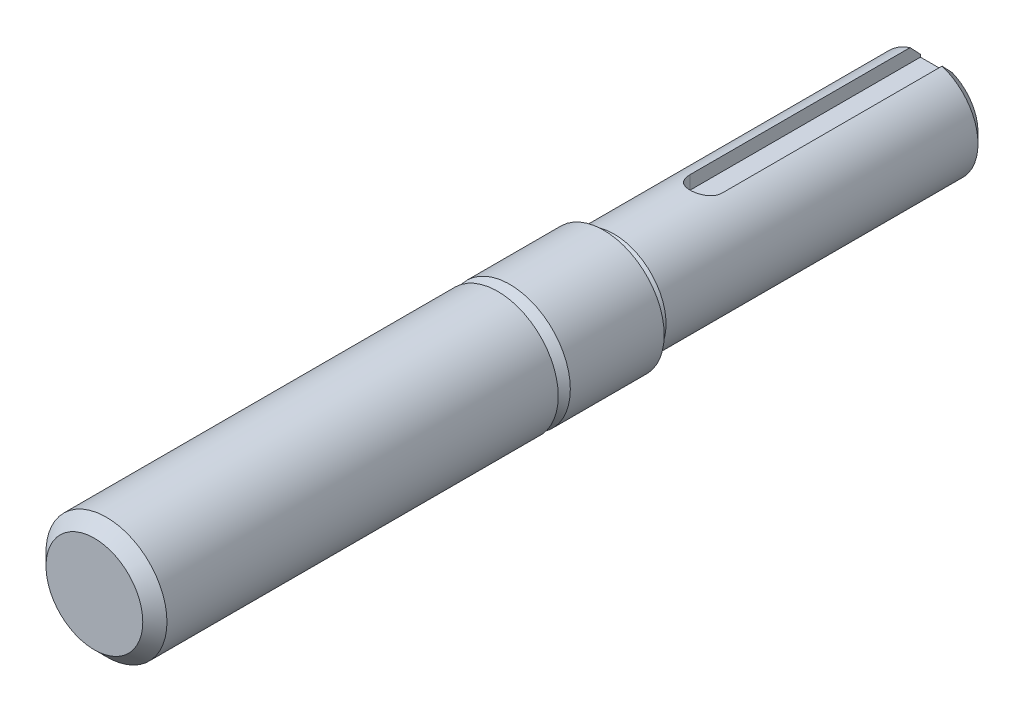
from build123d import *

# Parameters (mm, degrees)
F_123KEY_DEPTH = 85.326148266


with BuildPart() as part:
    # Sketch1 → Revolve1 (revolve)
    with BuildSketch(Plane(origin=(0, 0, 0), x_dir=(0, 0, -1), z_dir=(1, 0, 0)), mode=Mode.PRIVATE) as revolve1_sk:
        Polygon((0, 0), (0, 4.801616), (1.200404, 6.00202), (40.0304, 6.00202), (40.0304, 4.801616), (41.230804, 6.00202), (50.546, 6.00202), (50.546, 4.64058), (51.57724, 5.1562), (82.53476, 5.1562), (83.566, 4.12496), (83.566, 0), align=None)
    revolve(revolve1_sk.sketch.rotate(Axis((0, 0, 0), (0, 0, -1)), 90), axis=Axis((0, 0, 0), (0, 0, -1)))

    # Sketch4 → 123Key (cut, through all)
    with BuildSketch(Plane.XZ.offset(-3.5687)):
        with BuildLine():
            Line((1.590100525, -83.566), (1.590100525, -60.706))
            ThreePointArc((1.590100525, -60.706), (0.002600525, -59.1185), (-1.584899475, -60.706))
            Line((-1.584899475, -60.706), (-1.584899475, -83.566))
            Line((-1.584899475, -83.566), (1.590100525, -83.566))
        make_face()
    extrude(amount=-F_123KEY_DEPTH, mode=Mode.SUBTRACT)


solid = part.part
